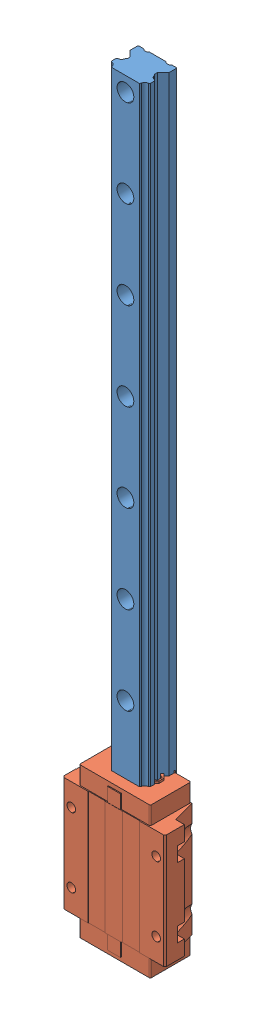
SolidWorks assembly HXW30HA1R1000ZOC+E22020.step.sldasm, configuration 默认 (file format 13000). Lengths in mm.
Overall size (140 1040 60).
2 component instances, 2 part files, 0 mates.
Components (placement in the parent):
- HLR30R1000 E=20-1: HLR30R1000 E=20.SLDPRT [默认] at origin size (53 1000 44)
- HLW35HC-1: HLW35HC.SLDPRT [默认] at (0 65.2 16) size (140 210.4 57)
